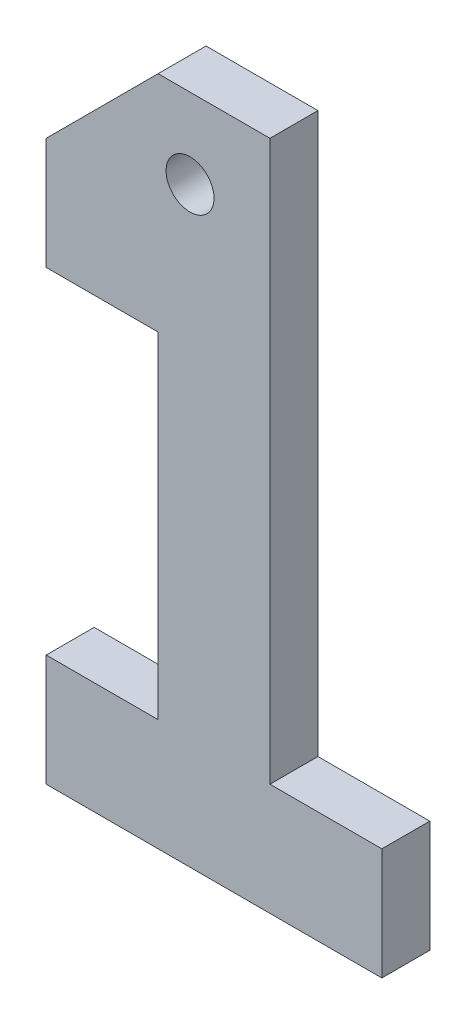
ISO-10303-21;
HEADER;
FILE_DESCRIPTION(('STEP AP214'),'2;1');
FILE_NAME('part.step','',(''),(''),'','','');
FILE_SCHEMA(('AUTOMOTIVE_DESIGN { 1 0 10303 214 1 1 1 1 }'));
ENDSEC;
DATA;
#1=APPLICATION_CONTEXT('core data for automotive mechanical design processes');
#2=APPLICATION_PROTOCOL_DEFINITION('international standard','automotive_design',2000,#1);
#3=PRODUCT_CONTEXT('',#1,'mechanical');
#4=PRODUCT('Part','Part','',(#3));
#5=PRODUCT_RELATED_PRODUCT_CATEGORY('part','',(#4));
#6=PRODUCT_DEFINITION_FORMATION('','',#4);
#7=PRODUCT_DEFINITION_CONTEXT('part definition',#1,'design');
#8=PRODUCT_DEFINITION('design','',#6,#7);
#9=PRODUCT_DEFINITION_SHAPE('','',#8);
#10=(LENGTH_UNIT() NAMED_UNIT(*) SI_UNIT(.MILLI.,.METRE.));
#11=(NAMED_UNIT(*) PLANE_ANGLE_UNIT() SI_UNIT($,.RADIAN.));
#12=(NAMED_UNIT(*) SI_UNIT($,.STERADIAN.) SOLID_ANGLE_UNIT());
#13=UNCERTAINTY_MEASURE_WITH_UNIT(LENGTH_MEASURE(1.E-05),#10,'distance_accuracy_value','');
#14=(GEOMETRIC_REPRESENTATION_CONTEXT(3) GLOBAL_UNCERTAINTY_ASSIGNED_CONTEXT((#13)) GLOBAL_UNIT_ASSIGNED_CONTEXT((#10,
#11,#12)) REPRESENTATION_CONTEXT('',''));
#15=CARTESIAN_POINT('',(0.,0.,0.));
#16=DIRECTION('',(0.,0.,1.));
#17=DIRECTION('',(1.,0.,0.));
#18=AXIS2_PLACEMENT_3D('',#15,#16,#17);
#19=CARTESIAN_POINT('',(0.,14.,6.));
#20=DIRECTION('',(0.,0.,-1.));
#21=DIRECTION('',(-1.,0.,0.));
#22=AXIS2_PLACEMENT_3D('',#19,#20,#21);
#23=PLANE('',#22);
#24=DIRECTION('',(0.,-1.,0.));
#25=VECTOR('',#24,1.);
#26=CARTESIAN_POINT('',(0.,0.,6.));
#27=LINE('',#26,#25);
#28=CARTESIAN_POINT('',(0.,14.,6.));
#29=VERTEX_POINT('',#28);
#30=CARTESIAN_POINT('',(0.,0.,6.));
#31=VERTEX_POINT('',#30);
#32=EDGE_CURVE('E173',#29,#31,#27,.T.);
#33=ORIENTED_EDGE('',*,*,#32,.T.);
#34=DIRECTION('',(1.,0.,0.));
#35=VECTOR('',#34,1.);
#36=CARTESIAN_POINT('',(0.,0.,6.));
#37=LINE('',#36,#35);
#38=CARTESIAN_POINT('',(42.,0.,6.));
#39=VERTEX_POINT('',#38);
#40=EDGE_CURVE('E106',#31,#39,#37,.T.);
#41=ORIENTED_EDGE('',*,*,#40,.T.);
#42=DIRECTION('',(0.,1.,0.));
#43=VECTOR('',#42,1.);
#44=CARTESIAN_POINT('',(42.,0.,6.));
#45=LINE('',#44,#43);
#46=CARTESIAN_POINT('',(42.,14.,6.));
#47=VERTEX_POINT('',#46);
#48=EDGE_CURVE('E197',#39,#47,#45,.T.);
#49=ORIENTED_EDGE('',*,*,#48,.T.);
#50=DIRECTION('',(-1.,0.,0.));
#51=VECTOR('',#50,1.);
#52=CARTESIAN_POINT('',(42.,14.,6.));
#53=LINE('',#52,#51);
#54=CARTESIAN_POINT('',(28.,14.,6.));
#55=VERTEX_POINT('',#54);
#56=EDGE_CURVE('E216',#47,#55,#53,.T.);
#57=ORIENTED_EDGE('',*,*,#56,.T.);
#58=DIRECTION('',(0.,1.,0.));
#59=VECTOR('',#58,1.);
#60=CARTESIAN_POINT('',(28.,14.,6.));
#61=LINE('',#60,#59);
#62=CARTESIAN_POINT('',(28.,84.,6.));
#63=VERTEX_POINT('',#62);
#64=EDGE_CURVE('E213',#55,#63,#61,.T.);
#65=ORIENTED_EDGE('',*,*,#64,.T.);
#66=DIRECTION('',(-1.,0.,0.));
#67=VECTOR('',#66,1.);
#68=CARTESIAN_POINT('',(14.,84.,6.));
#69=LINE('',#68,#67);
#70=CARTESIAN_POINT('',(14.,84.,6.));
#71=VERTEX_POINT('',#70);
#72=EDGE_CURVE('E215',#63,#71,#69,.T.);
#73=ORIENTED_EDGE('',*,*,#72,.T.);
#74=DIRECTION('',(-0.707106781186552,-0.707106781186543,0.));
#75=VECTOR('',#74,1.);
#76=CARTESIAN_POINT('',(-1.74574168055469E-13,70.,6.));
#77=LINE('',#76,#75);
#78=CARTESIAN_POINT('',(-1.74574168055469E-13,70.,6.));
#79=VERTEX_POINT('',#78);
#80=EDGE_CURVE('E218',#71,#79,#77,.T.);
#81=ORIENTED_EDGE('',*,*,#80,.T.);
#82=DIRECTION('',(0.,-1.,0.));
#83=VECTOR('',#82,1.);
#84=CARTESIAN_POINT('',(-1.74574168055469E-13,56.,6.));
#85=LINE('',#84,#83);
#86=CARTESIAN_POINT('',(-1.74574168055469E-13,56.,6.));
#87=VERTEX_POINT('',#86);
#88=EDGE_CURVE('E134',#79,#87,#85,.T.);
#89=ORIENTED_EDGE('',*,*,#88,.T.);
#90=DIRECTION('',(1.,0.,0.));
#91=VECTOR('',#90,1.);
#92=CARTESIAN_POINT('',(14.,56.,6.));
#93=LINE('',#92,#91);
#94=CARTESIAN_POINT('',(14.,56.,6.));
#95=VERTEX_POINT('',#94);
#96=EDGE_CURVE('E128',#87,#95,#93,.T.);
#97=ORIENTED_EDGE('',*,*,#96,.T.);
#98=DIRECTION('',(0.,-1.,0.));
#99=VECTOR('',#98,1.);
#100=CARTESIAN_POINT('',(14.,14.,6.));
#101=LINE('',#100,#99);
#102=CARTESIAN_POINT('',(14.,14.,6.));
#103=VERTEX_POINT('',#102);
#104=EDGE_CURVE('E132',#95,#103,#101,.T.);
#105=ORIENTED_EDGE('',*,*,#104,.T.);
#106=DIRECTION('',(-1.,0.,0.));
#107=VECTOR('',#106,1.);
#108=CARTESIAN_POINT('',(0.,14.,6.));
#109=LINE('',#108,#107);
#110=EDGE_CURVE('E54',#103,#29,#109,.T.);
#111=ORIENTED_EDGE('',*,*,#110,.T.);
#112=EDGE_LOOP('',(#33,#41,#49,#57,#65,#73,#81,#89,#97,#105,#111));
#113=FACE_BOUND('',#112,.T.);
#114=CARTESIAN_POINT('',(18.,74.,6.));
#115=DIRECTION('',(0.,0.,1.));
#116=DIRECTION('',(1.,0.,0.));
#117=AXIS2_PLACEMENT_3D('',#114,#115,#116);
#118=CIRCLE('',#117,3.);
#119=CARTESIAN_POINT('',(21.,74.,6.));
#120=VERTEX_POINT('',#119);
#121=EDGE_CURVE('E156',#120,#120,#118,.T.);
#122=ORIENTED_EDGE('',*,*,#121,.F.);
#123=EDGE_LOOP('',(#122));
#124=FACE_BOUND('',#123,.T.);
#125=ADVANCED_FACE('F37',(#113,#124),#23,.F.);
#126=CARTESIAN_POINT('',(0.,14.,0.));
#127=DIRECTION('',(0.,0.,-1.));
#128=DIRECTION('',(-1.,0.,0.));
#129=AXIS2_PLACEMENT_3D('',#126,#127,#128);
#130=PLANE('',#129);
#131=DIRECTION('',(0.,-1.,0.));
#132=VECTOR('',#131,1.);
#133=CARTESIAN_POINT('',(0.,0.,0.));
#134=LINE('',#133,#132);
#135=CARTESIAN_POINT('',(0.,14.,0.));
#136=VERTEX_POINT('',#135);
#137=CARTESIAN_POINT('',(0.,0.,0.));
#138=VERTEX_POINT('',#137);
#139=EDGE_CURVE('E152',#136,#138,#134,.T.);
#140=ORIENTED_EDGE('',*,*,#139,.F.);
#141=DIRECTION('',(-1.,0.,0.));
#142=VECTOR('',#141,1.);
#143=CARTESIAN_POINT('',(0.,14.,0.));
#144=LINE('',#143,#142);
#145=CARTESIAN_POINT('',(14.,14.,0.));
#146=VERTEX_POINT('',#145);
#147=EDGE_CURVE('E98',#146,#136,#144,.T.);
#148=ORIENTED_EDGE('',*,*,#147,.F.);
#149=DIRECTION('',(0.,-1.,0.));
#150=VECTOR('',#149,1.);
#151=CARTESIAN_POINT('',(14.,14.,0.));
#152=LINE('',#151,#150);
#153=CARTESIAN_POINT('',(14.,56.,0.));
#154=VERTEX_POINT('',#153);
#155=EDGE_CURVE('E92',#154,#146,#152,.T.);
#156=ORIENTED_EDGE('',*,*,#155,.F.);
#157=DIRECTION('',(1.,0.,0.));
#158=VECTOR('',#157,1.);
#159=CARTESIAN_POINT('',(14.,56.,0.));
#160=LINE('',#159,#158);
#161=CARTESIAN_POINT('',(-1.74574168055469E-13,56.,0.));
#162=VERTEX_POINT('',#161);
#163=EDGE_CURVE('E142',#162,#154,#160,.T.);
#164=ORIENTED_EDGE('',*,*,#163,.F.);
#165=DIRECTION('',(0.,-1.,0.));
#166=VECTOR('',#165,1.);
#167=CARTESIAN_POINT('',(-1.74574168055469E-13,56.,0.));
#168=LINE('',#167,#166);
#169=CARTESIAN_POINT('',(-1.74574168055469E-13,70.,0.));
#170=VERTEX_POINT('',#169);
#171=EDGE_CURVE('E168',#170,#162,#168,.T.);
#172=ORIENTED_EDGE('',*,*,#171,.F.);
#173=DIRECTION('',(-0.707106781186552,-0.707106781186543,0.));
#174=VECTOR('',#173,1.);
#175=CARTESIAN_POINT('',(-1.74574168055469E-13,70.,0.));
#176=LINE('',#175,#174);
#177=CARTESIAN_POINT('',(14.,84.,0.));
#178=VERTEX_POINT('',#177);
#179=EDGE_CURVE('E166',#178,#170,#176,.T.);
#180=ORIENTED_EDGE('',*,*,#179,.F.);
#181=DIRECTION('',(-1.,0.,0.));
#182=VECTOR('',#181,1.);
#183=CARTESIAN_POINT('',(14.,84.,0.));
#184=LINE('',#183,#182);
#185=CARTESIAN_POINT('',(28.,84.,0.));
#186=VERTEX_POINT('',#185);
#187=EDGE_CURVE('E164',#186,#178,#184,.T.);
#188=ORIENTED_EDGE('',*,*,#187,.F.);
#189=DIRECTION('',(0.,1.,0.));
#190=VECTOR('',#189,1.);
#191=CARTESIAN_POINT('',(28.,14.,0.));
#192=LINE('',#191,#190);
#193=CARTESIAN_POINT('',(28.,14.,0.));
#194=VERTEX_POINT('',#193);
#195=EDGE_CURVE('E162',#194,#186,#192,.T.);
#196=ORIENTED_EDGE('',*,*,#195,.F.);
#197=DIRECTION('',(-1.,0.,0.));
#198=VECTOR('',#197,1.);
#199=CARTESIAN_POINT('',(42.,14.,0.));
#200=LINE('',#199,#198);
#201=CARTESIAN_POINT('',(42.,14.,0.));
#202=VERTEX_POINT('',#201);
#203=EDGE_CURVE('E160',#202,#194,#200,.T.);
#204=ORIENTED_EDGE('',*,*,#203,.F.);
#205=DIRECTION('',(0.,1.,0.));
#206=VECTOR('',#205,1.);
#207=CARTESIAN_POINT('',(42.,0.,0.));
#208=LINE('',#207,#206);
#209=CARTESIAN_POINT('',(42.,0.,0.));
#210=VERTEX_POINT('',#209);
#211=EDGE_CURVE('E158',#210,#202,#208,.T.);
#212=ORIENTED_EDGE('',*,*,#211,.F.);
#213=DIRECTION('',(1.,0.,0.));
#214=VECTOR('',#213,1.);
#215=CARTESIAN_POINT('',(0.,0.,0.));
#216=LINE('',#215,#214);
#217=EDGE_CURVE('E155',#138,#210,#216,.T.);
#218=ORIENTED_EDGE('',*,*,#217,.F.);
#219=EDGE_LOOP('',(#140,#148,#156,#164,#172,#180,#188,#196,#204,#212,#218));
#220=FACE_BOUND('',#219,.T.);
#221=CARTESIAN_POINT('',(18.,74.,0.));
#222=DIRECTION('',(0.,0.,1.));
#223=DIRECTION('',(1.,0.,0.));
#224=AXIS2_PLACEMENT_3D('',#221,#222,#223);
#225=CIRCLE('',#224,3.);
#226=CARTESIAN_POINT('',(21.,74.,0.));
#227=VERTEX_POINT('',#226);
#228=EDGE_CURVE('E356',#227,#227,#225,.T.);
#229=ORIENTED_EDGE('',*,*,#228,.T.);
#230=EDGE_LOOP('',(#229));
#231=FACE_BOUND('',#230,.T.);
#232=ADVANCED_FACE('F201',(#220,#231),#130,.T.);
#233=CARTESIAN_POINT('',(0.,0.,6.));
#234=DIRECTION('',(1.,0.,0.));
#235=DIRECTION('',(0.,0.,-1.));
#236=AXIS2_PLACEMENT_3D('',#233,#234,#235);
#237=PLANE('',#236);
#238=ORIENTED_EDGE('',*,*,#139,.T.);
#239=DIRECTION('',(0.,0.,-1.));
#240=VECTOR('',#239,1.);
#241=CARTESIAN_POINT('',(0.,0.,6.));
#242=LINE('',#241,#240);
#243=EDGE_CURVE('E11',#31,#138,#242,.T.);
#244=ORIENTED_EDGE('',*,*,#243,.F.);
#245=ORIENTED_EDGE('',*,*,#32,.F.);
#246=DIRECTION('',(0.,0.,-1.));
#247=VECTOR('',#246,1.);
#248=CARTESIAN_POINT('',(0.,14.,6.));
#249=LINE('',#248,#247);
#250=EDGE_CURVE('E148',#29,#136,#249,.T.);
#251=ORIENTED_EDGE('',*,*,#250,.T.);
#252=EDGE_LOOP('',(#238,#244,#245,#251));
#253=FACE_BOUND('',#252,.T.);
#254=ADVANCED_FACE('F39',(#253),#237,.F.);
#255=CARTESIAN_POINT('',(0.,0.,6.));
#256=DIRECTION('',(0.,1.,0.));
#257=DIRECTION('',(0.,0.,1.));
#258=AXIS2_PLACEMENT_3D('',#255,#256,#257);
#259=PLANE('',#258);
#260=ORIENTED_EDGE('',*,*,#217,.T.);
#261=DIRECTION('',(0.,0.,-1.));
#262=VECTOR('',#261,1.);
#263=CARTESIAN_POINT('',(42.,0.,6.));
#264=LINE('',#263,#262);
#265=EDGE_CURVE('E46',#39,#210,#264,.T.);
#266=ORIENTED_EDGE('',*,*,#265,.F.);
#267=ORIENTED_EDGE('',*,*,#40,.F.);
#268=ORIENTED_EDGE('',*,*,#243,.T.);
#269=EDGE_LOOP('',(#260,#266,#267,#268));
#270=FACE_BOUND('',#269,.T.);
#271=ADVANCED_FACE('F255',(#270),#259,.F.);
#272=CARTESIAN_POINT('',(42.,0.,6.));
#273=DIRECTION('',(-1.,0.,0.));
#274=DIRECTION('',(0.,-1.,0.));
#275=AXIS2_PLACEMENT_3D('',#272,#273,#274);
#276=PLANE('',#275);
#277=ORIENTED_EDGE('',*,*,#211,.T.);
#278=DIRECTION('',(0.,0.,-1.));
#279=VECTOR('',#278,1.);
#280=CARTESIAN_POINT('',(42.,14.,6.));
#281=LINE('',#280,#279);
#282=EDGE_CURVE('E189',#47,#202,#281,.T.);
#283=ORIENTED_EDGE('',*,*,#282,.F.);
#284=ORIENTED_EDGE('',*,*,#48,.F.);
#285=ORIENTED_EDGE('',*,*,#265,.T.);
#286=EDGE_LOOP('',(#277,#283,#284,#285));
#287=FACE_BOUND('',#286,.T.);
#288=ADVANCED_FACE('F195',(#287),#276,.F.);
#289=CARTESIAN_POINT('',(42.,14.,6.));
#290=DIRECTION('',(0.,-1.,0.));
#291=DIRECTION('',(1.,0.,0.));
#292=AXIS2_PLACEMENT_3D('',#289,#290,#291);
#293=PLANE('',#292);
#294=ORIENTED_EDGE('',*,*,#203,.T.);
#295=DIRECTION('',(0.,0.,-1.));
#296=VECTOR('',#295,1.);
#297=CARTESIAN_POINT('',(28.,14.,6.));
#298=LINE('',#297,#296);
#299=EDGE_CURVE('E186',#55,#194,#298,.T.);
#300=ORIENTED_EDGE('',*,*,#299,.F.);
#301=ORIENTED_EDGE('',*,*,#56,.F.);
#302=ORIENTED_EDGE('',*,*,#282,.T.);
#303=EDGE_LOOP('',(#294,#300,#301,#302));
#304=FACE_BOUND('',#303,.T.);
#305=ADVANCED_FACE('F207',(#304),#293,.F.);
#306=CARTESIAN_POINT('',(28.,14.,6.));
#307=DIRECTION('',(-1.,0.,0.));
#308=DIRECTION('',(0.,-1.,0.));
#309=AXIS2_PLACEMENT_3D('',#306,#307,#308);
#310=PLANE('',#309);
#311=ORIENTED_EDGE('',*,*,#195,.T.);
#312=DIRECTION('',(0.,0.,-1.));
#313=VECTOR('',#312,1.);
#314=CARTESIAN_POINT('',(28.,84.,6.));
#315=LINE('',#314,#313);
#316=EDGE_CURVE('E183',#63,#186,#315,.T.);
#317=ORIENTED_EDGE('',*,*,#316,.F.);
#318=ORIENTED_EDGE('',*,*,#64,.F.);
#319=ORIENTED_EDGE('',*,*,#299,.T.);
#320=EDGE_LOOP('',(#311,#317,#318,#319));
#321=FACE_BOUND('',#320,.T.);
#322=ADVANCED_FACE('F211',(#321),#310,.F.);
#323=CARTESIAN_POINT('',(14.,84.,6.));
#324=DIRECTION('',(0.,-1.,0.));
#325=DIRECTION('',(0.,0.,-1.));
#326=AXIS2_PLACEMENT_3D('',#323,#324,#325);
#327=PLANE('',#326);
#328=ORIENTED_EDGE('',*,*,#187,.T.);
#329=DIRECTION('',(0.,0.,-1.));
#330=VECTOR('',#329,1.);
#331=CARTESIAN_POINT('',(14.,84.,6.));
#332=LINE('',#331,#330);
#333=EDGE_CURVE('E180',#71,#178,#332,.T.);
#334=ORIENTED_EDGE('',*,*,#333,.F.);
#335=ORIENTED_EDGE('',*,*,#72,.F.);
#336=ORIENTED_EDGE('',*,*,#316,.T.);
#337=EDGE_LOOP('',(#328,#334,#335,#336));
#338=FACE_BOUND('',#337,.T.);
#339=ADVANCED_FACE('F268',(#338),#327,.F.);
#340=CARTESIAN_POINT('',(-1.74574168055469E-13,70.,6.));
#341=DIRECTION('',(0.707106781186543,-0.707106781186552,0.));
#342=DIRECTION('',(0.707106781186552,0.707106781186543,0.));
#343=AXIS2_PLACEMENT_3D('',#340,#341,#342);
#344=PLANE('',#343);
#345=ORIENTED_EDGE('',*,*,#179,.T.);
#346=DIRECTION('',(0.,0.,-1.));
#347=VECTOR('',#346,1.);
#348=CARTESIAN_POINT('',(-1.74574168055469E-13,70.,6.));
#349=LINE('',#348,#347);
#350=EDGE_CURVE('E177',#79,#170,#349,.T.);
#351=ORIENTED_EDGE('',*,*,#350,.F.);
#352=ORIENTED_EDGE('',*,*,#80,.F.);
#353=ORIENTED_EDGE('',*,*,#333,.T.);
#354=EDGE_LOOP('',(#345,#351,#352,#353));
#355=FACE_BOUND('',#354,.T.);
#356=ADVANCED_FACE('F227',(#355),#344,.F.);
#357=CARTESIAN_POINT('',(-1.74574168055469E-13,56.,6.));
#358=DIRECTION('',(1.,0.,0.));
#359=DIRECTION('',(0.,0.,-1.));
#360=AXIS2_PLACEMENT_3D('',#357,#358,#359);
#361=PLANE('',#360);
#362=ORIENTED_EDGE('',*,*,#171,.T.);
#363=DIRECTION('',(0.,0.,-1.));
#364=VECTOR('',#363,1.);
#365=CARTESIAN_POINT('',(-1.74574168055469E-13,56.,6.));
#366=LINE('',#365,#364);
#367=EDGE_CURVE('E143',#87,#162,#366,.T.);
#368=ORIENTED_EDGE('',*,*,#367,.F.);
#369=ORIENTED_EDGE('',*,*,#88,.F.);
#370=ORIENTED_EDGE('',*,*,#350,.T.);
#371=EDGE_LOOP('',(#362,#368,#369,#370));
#372=FACE_BOUND('',#371,.T.);
#373=ADVANCED_FACE('F231',(#372),#361,.F.);
#374=CARTESIAN_POINT('',(14.,56.,6.));
#375=DIRECTION('',(0.,1.,0.));
#376=DIRECTION('',(-1.,0.,0.));
#377=AXIS2_PLACEMENT_3D('',#374,#375,#376);
#378=PLANE('',#377);
#379=ORIENTED_EDGE('',*,*,#163,.T.);
#380=DIRECTION('',(0.,0.,-1.));
#381=VECTOR('',#380,1.);
#382=CARTESIAN_POINT('',(14.,56.,6.));
#383=LINE('',#382,#381);
#384=EDGE_CURVE('E139',#95,#154,#383,.T.);
#385=ORIENTED_EDGE('',*,*,#384,.F.);
#386=ORIENTED_EDGE('',*,*,#96,.F.);
#387=ORIENTED_EDGE('',*,*,#367,.T.);
#388=EDGE_LOOP('',(#379,#385,#386,#387));
#389=FACE_BOUND('',#388,.T.);
#390=ADVANCED_FACE('F140',(#389),#378,.F.);
#391=CARTESIAN_POINT('',(14.,14.,6.));
#392=DIRECTION('',(1.,0.,0.));
#393=DIRECTION('',(0.,0.,-1.));
#394=AXIS2_PLACEMENT_3D('',#391,#392,#393);
#395=PLANE('',#394);
#396=ORIENTED_EDGE('',*,*,#155,.T.);
#397=DIRECTION('',(0.,0.,-1.));
#398=VECTOR('',#397,1.);
#399=CARTESIAN_POINT('',(14.,14.,6.));
#400=LINE('',#399,#398);
#401=EDGE_CURVE('E144',#103,#146,#400,.T.);
#402=ORIENTED_EDGE('',*,*,#401,.F.);
#403=ORIENTED_EDGE('',*,*,#104,.F.);
#404=ORIENTED_EDGE('',*,*,#384,.T.);
#405=EDGE_LOOP('',(#396,#402,#403,#404));
#406=FACE_BOUND('',#405,.T.);
#407=ADVANCED_FACE('F146',(#406),#395,.F.);
#408=CARTESIAN_POINT('',(0.,14.,6.));
#409=DIRECTION('',(0.,-1.,0.));
#410=DIRECTION('',(0.,0.,-1.));
#411=AXIS2_PLACEMENT_3D('',#408,#409,#410);
#412=PLANE('',#411);
#413=ORIENTED_EDGE('',*,*,#147,.T.);
#414=ORIENTED_EDGE('',*,*,#250,.F.);
#415=ORIENTED_EDGE('',*,*,#110,.F.);
#416=ORIENTED_EDGE('',*,*,#401,.T.);
#417=EDGE_LOOP('',(#413,#414,#415,#416));
#418=FACE_BOUND('',#417,.T.);
#419=ADVANCED_FACE('F235',(#418),#412,.F.);
#420=CARTESIAN_POINT('',(18.,74.,6.));
#421=DIRECTION('',(0.,0.,-1.));
#422=DIRECTION('',(-1.,0.,0.));
#423=AXIS2_PLACEMENT_3D('',#420,#421,#422);
#424=CYLINDRICAL_SURFACE('',#423,3.);
#425=ORIENTED_EDGE('',*,*,#121,.T.);
#426=EDGE_LOOP('',(#425));
#427=FACE_BOUND('',#426,.T.);
#428=ORIENTED_EDGE('',*,*,#228,.F.);
#429=EDGE_LOOP('',(#428));
#430=FACE_BOUND('',#429,.T.);
#431=ADVANCED_FACE('F237',(#427,#430),#424,.F.);
#432=CLOSED_SHELL('',(#125,#232,#254,#271,#288,#305,#322,#339,#356,#373,#390,#407,#419,#431));
#433=MANIFOLD_SOLID_BREP('B2',#432);
#434=ADVANCED_BREP_SHAPE_REPRESENTATION('',(#18,#433),#14);
#435=SHAPE_DEFINITION_REPRESENTATION(#9,#434);
ENDSEC;
END-ISO-10303-21;
